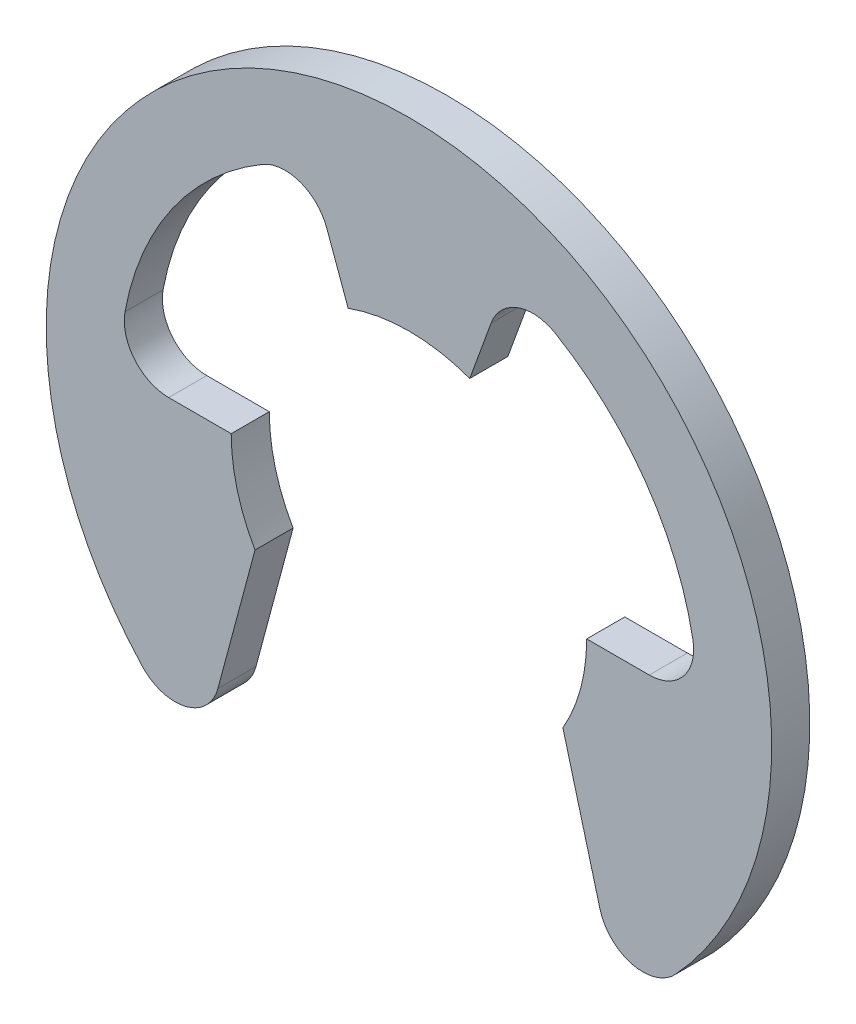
from build123d import *

# Parameters (mm, degrees)
BODY_DEPTH = 1.0668


with BuildPart() as part:
    # BodySke → Body (new body)
    with BuildSketch(Plane.XY):
        with BuildLine():
            Line((4.31142087, -2.4892), (5.35106206, -6.369193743))
            ThreePointArc((5.35106206, -6.369193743), (6.254528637, -7.254745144), (7.466125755, -6.89075948))
            ThreePointArc((7.466125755, -6.89075948), (0, 10.16), (-7.466125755, -6.89075948))
            ThreePointArc((-7.466125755, -6.89075948), (-6.254528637, -7.254745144), (-5.35106206, -6.369193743))
            Line((-5.35106206, -6.369193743), (-4.31142087, -2.4892))
            ThreePointArc((-4.31142087, -2.4892), (-4.808765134, -1.288504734), (-4.9784, 0))
            Line((-4.9784, 0), (-6.72984166, 0))
            ThreePointArc((-6.72984166, 0), (-7.685748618, 0.448132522), (-7.952722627, 1.469555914))
            ThreePointArc((-7.952722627, 1.469555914), (-6.624777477, 4.638719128), (-4.100922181, 6.970497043))
            ThreePointArc((-4.100922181, 6.970497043), (-3.049787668, 7.068970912), (-2.301741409, 6.323982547))
            Line((-2.301741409, 6.323982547), (-1.702713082, 4.678165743))
            ThreePointArc((-1.702713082, 4.678165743), (0, 4.9784), (1.702713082, 4.678165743))
            Line((1.702713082, 4.678165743), (2.301741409, 6.323982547))
            ThreePointArc((2.301741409, 6.323982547), (3.049787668, 7.068970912), (4.100922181, 6.970497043))
            ThreePointArc((4.100922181, 6.970497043), (6.624777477, 4.638719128), (7.952722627, 1.469555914))
            ThreePointArc((7.952722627, 1.469555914), (7.685748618, 0.448132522), (6.72984166, 0))
            Line((6.72984166, 0), (4.9784, 0))
            ThreePointArc((4.9784, 0), (4.808765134, -1.288504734), (4.31142087, -2.4892))
        make_face()
    extrude(amount=-BODY_DEPTH)


solid = part.part
